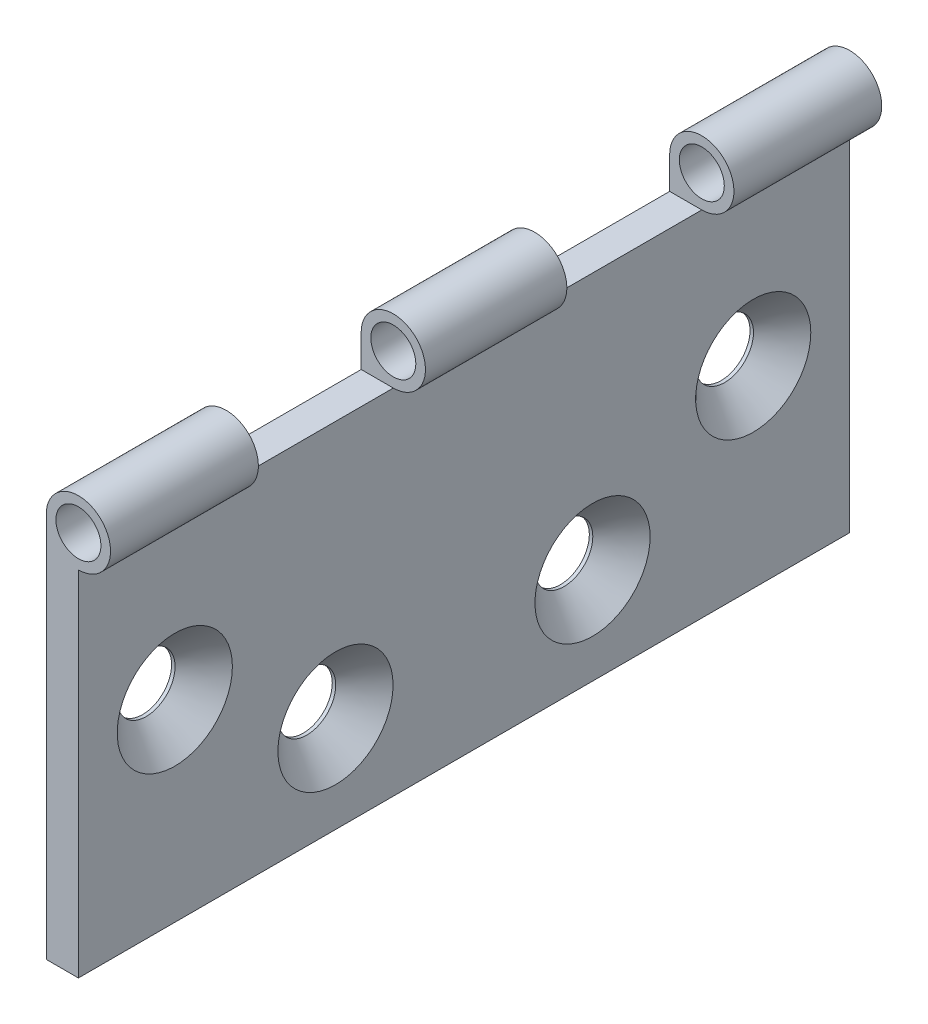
from build123d import *

# Parameters (mm, degrees)
CROQUIS1_W                                   = 5
CROQUIS1_H                                   = 60
EXTRUIR_L_MINA1_DEPTH                        = 60
CROQUIS2_R                                   = 5
CROQUIS3_R                                   = 3.5
CORTAR_EXTRUIR1_DEPTH                        = 137.839321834
REFRENTADO_PARA_TORNILLO_TAP_N_CON_C_2_COUNT = 2
REFRENTADO_PARA_TORNILLO_TAP_N_CON_C_2_PITCH = 29.154759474
F_2CORTES_DEPTH                              = 89.600225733
F_2CORTES_DEPTH_BACK                         = 89.600225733
CROQUIS11_W                                  = 26
CROQUIS11_H                                  = 10


with BuildPart() as part:
    # Croquis1 → Extruir-L_mina1 (new, symmetric)
    with BuildSketch(Plane.XY):
        with Locations((2.5, 30)):
            Rectangle(CROQUIS1_W, CROQUIS1_H)
    extrude(amount=EXTRUIR_L_MINA1_DEPTH, both=True)

    # Barrer1: sweep along a curve in space
    with BuildLine() as barrer1_path:
        Line((5, 60, 60), (5, 60, -60))
    # Croquis2 → Barrer1 (sweep)
    with BuildSketch(Plane.XY.offset(60)):
        with Locations((5, 60)):
            Circle(CROQUIS2_R)
    sweep(path=barrer1_path.line)

    # Croquis3 → Cortar-Extruir1 (cut, through all)
    with BuildSketch(Plane.XY.offset(60)):
        with Locations((5, 60)):
            Circle(CROQUIS3_R)
    extrude(amount=-CORTAR_EXTRUIR1_DEPTH, mode=Mode.SUBTRACT)

    # Croquis6 → Refrentado para tornillo tap_n con cabez (revolve, cut)
    with BuildSketch(Plane(origin=(5, 30, 45), x_dir=(0, 0, -1), z_dir=(0, 1, 0))):
        Polygon((0, 0), (0, 5), (4.5, 5), (4.5, 4.46), (8.96, 0), align=None)
    refrentado_para_tornillo_tap_n_con_cabez = revolve(axis=Axis((11.35, 30, 45), (-1, 0, 0)), mode=Mode.SUBTRACT)

    # Refrentado para tornillo tap_n con c 2: Refrentado para tornillo tap_n con cabez ×2
    with Locations(*[Vector(1.797391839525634e-15, -0.5144957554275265, -0.8574929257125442) * (i * REFRENTADO_PARA_TORNILLO_TAP_N_CON_C_2_PITCH) for i in range(1, REFRENTADO_PARA_TORNILLO_TAP_N_CON_C_2_COUNT)]):
        add(refrentado_para_tornillo_tap_n_con_cabez, mode=Mode.SUBTRACT)

    # Simetr_a1: Refrentado para tornillo tap_n con cabez across plane
    add(refrentado_para_tornillo_tap_n_con_cabez.mirror(Plane.XY), mode=Mode.SUBTRACT)

    # Simetr_a1 copy 1 sketch → Simetr_a1 copy 1 (revolve, cut)
    with BuildSketch(Plane(origin=(5, 15, -20), x_dir=(0, 0, 1), z_dir=(0, 1, 0))):
        Polygon((0, 0), (0, -5), (4.5, -5), (4.5, -4.46), (8.96, 0), align=None)
    revolve(axis=Axis((11.35, 15, -20), (1, 0, 0)), mode=Mode.SUBTRACT)

    # Croquis11 → 2Cortes (cut, two sides: drawn at the far end of the back side and taken through both)
    with BuildSketch(Plane(origin=(5, 0, 0), x_dir=(0, 0, -1), z_dir=(1, 0, 0)).offset(-F_2CORTES_DEPTH_BACK)):
        with Locations((-24, 60)):
            Rectangle(CROQUIS11_W, CROQUIS11_H)
        with Locations((24, 60)):
            Rectangle(CROQUIS11_W, CROQUIS11_H)
    extrude(amount=F_2CORTES_DEPTH + F_2CORTES_DEPTH_BACK, mode=Mode.SUBTRACT)


solid = part.part
